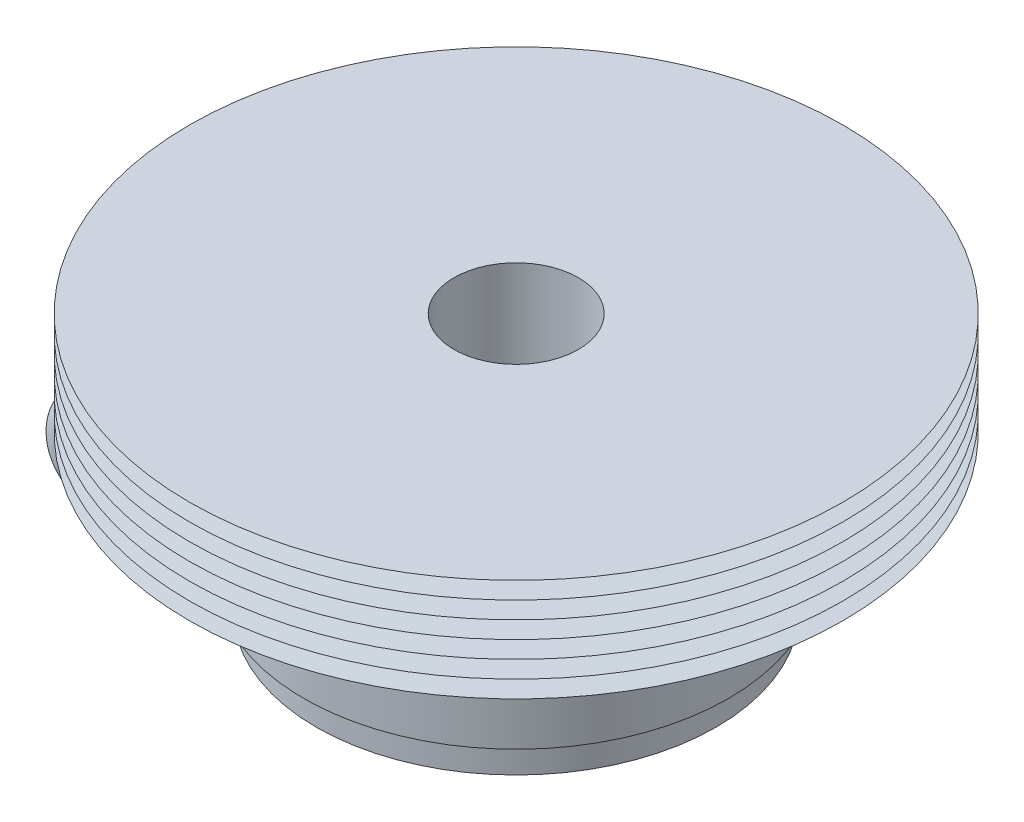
ISO-10303-21;
HEADER;
FILE_DESCRIPTION(('STEP AP214'),'2;1');
FILE_NAME('part.step','',(''),(''),'','','');
FILE_SCHEMA(('AUTOMOTIVE_DESIGN { 1 0 10303 214 1 1 1 1 }'));
ENDSEC;
DATA;
#1=APPLICATION_CONTEXT('core data for automotive mechanical design processes');
#2=APPLICATION_PROTOCOL_DEFINITION('international standard','automotive_design',2000,#1);
#3=PRODUCT_CONTEXT('',#1,'mechanical');
#4=PRODUCT('Part','Part','',(#3));
#5=PRODUCT_RELATED_PRODUCT_CATEGORY('part','',(#4));
#6=PRODUCT_DEFINITION_FORMATION('','',#4);
#7=PRODUCT_DEFINITION_CONTEXT('part definition',#1,'design');
#8=PRODUCT_DEFINITION('design','',#6,#7);
#9=PRODUCT_DEFINITION_SHAPE('','',#8);
#10=(LENGTH_UNIT() NAMED_UNIT(*) SI_UNIT(.MILLI.,.METRE.));
#11=(NAMED_UNIT(*) PLANE_ANGLE_UNIT() SI_UNIT($,.RADIAN.));
#12=(NAMED_UNIT(*) SI_UNIT($,.STERADIAN.) SOLID_ANGLE_UNIT());
#13=UNCERTAINTY_MEASURE_WITH_UNIT(LENGTH_MEASURE(1.E-05),#10,'distance_accuracy_value','');
#14=(GEOMETRIC_REPRESENTATION_CONTEXT(3) GLOBAL_UNCERTAINTY_ASSIGNED_CONTEXT((#13)) GLOBAL_UNIT_ASSIGNED_CONTEXT((#10,
#11,#12)) REPRESENTATION_CONTEXT('',''));
#15=CARTESIAN_POINT('',(0.,0.,0.));
#16=DIRECTION('',(0.,0.,1.));
#17=DIRECTION('',(1.,0.,0.));
#18=AXIS2_PLACEMENT_3D('',#15,#16,#17);
#19=CARTESIAN_POINT('',(0.,0.,0.));
#20=DIRECTION('',(0.,-1.,0.));
#21=DIRECTION('',(0.,0.,-1.));
#22=AXIS2_PLACEMENT_3D('',#19,#20,#21);
#23=CYLINDRICAL_SURFACE('',#22,13.65);
#24=CARTESIAN_POINT('',(0.,8.,0.));
#25=DIRECTION('',(0.,-1.,0.));
#26=DIRECTION('',(0.,0.,-1.));
#27=AXIS2_PLACEMENT_3D('',#24,#25,#26);
#28=CIRCLE('',#27,13.65);
#29=CARTESIAN_POINT('',(-12.85,8.,-4.60434577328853));
#30=VERTEX_POINT('',#29);
#31=CARTESIAN_POINT('',(-12.85,8.,4.60434577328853));
#32=VERTEX_POINT('',#31);
#33=EDGE_CURVE('E11',#30,#32,#28,.T.);
#34=ORIENTED_EDGE('',*,*,#33,.T.);
#35=DIRECTION('',(0.,-1.,0.));
#36=VECTOR('',#35,1.);
#37=CARTESIAN_POINT('',(-12.85,0.,4.60434577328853));
#38=LINE('',#37,#36);
#39=CARTESIAN_POINT('',(-12.85,2.,4.60434577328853));
#40=VERTEX_POINT('',#39);
#41=EDGE_CURVE('E26',#32,#40,#38,.T.);
#42=ORIENTED_EDGE('',*,*,#41,.T.);
#43=CARTESIAN_POINT('',(0.,2.,0.));
#44=DIRECTION('',(0.,-1.,0.));
#45=DIRECTION('',(0.,0.,-1.));
#46=AXIS2_PLACEMENT_3D('',#43,#44,#45);
#47=CIRCLE('',#46,13.65);
#48=CARTESIAN_POINT('',(-12.85,2.,-4.60434577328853));
#49=VERTEX_POINT('',#48);
#50=EDGE_CURVE('E50',#49,#40,#47,.T.);
#51=ORIENTED_EDGE('',*,*,#50,.F.);
#52=DIRECTION('',(0.,1.,0.));
#53=VECTOR('',#52,1.);
#54=CARTESIAN_POINT('',(-12.85,0.,-4.60434577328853));
#55=LINE('',#54,#53);
#56=EDGE_CURVE('E191',#49,#30,#55,.T.);
#57=ORIENTED_EDGE('',*,*,#56,.T.);
#58=EDGE_LOOP('',(#34,#42,#51,#57));
#59=FACE_BOUND('',#58,.T.);
#60=ADVANCED_FACE('F16',(#59),#23,.T.);
#61=CARTESIAN_POINT('',(0.,0.,0.));
#62=DIRECTION('',(0.,-1.,0.));
#63=DIRECTION('',(0.,0.,-1.));
#64=AXIS2_PLACEMENT_3D('',#61,#62,#63);
#65=CYLINDRICAL_SURFACE('',#64,4.);
#66=CARTESIAN_POINT('',(0.,4.,0.));
#67=DIRECTION('',(0.,-1.,0.));
#68=DIRECTION('',(0.,0.,-1.));
#69=AXIS2_PLACEMENT_3D('',#66,#67,#68);
#70=CIRCLE('',#69,4.);
#71=CARTESIAN_POINT('',(0.,4.,-4.));
#72=VERTEX_POINT('',#71);
#73=EDGE_CURVE('E187',#72,#72,#70,.T.);
#74=ORIENTED_EDGE('',*,*,#73,.T.);
#75=EDGE_LOOP('',(#74));
#76=FACE_BOUND('',#75,.T.);
#77=CARTESIAN_POINT('',(0.,16.6,0.));
#78=DIRECTION('',(0.,-1.,0.));
#79=DIRECTION('',(0.,0.,-1.));
#80=AXIS2_PLACEMENT_3D('',#77,#78,#79);
#81=CIRCLE('',#80,4.);
#82=CARTESIAN_POINT('',(0.,16.6,-4.));
#83=VERTEX_POINT('',#82);
#84=EDGE_CURVE('E177',#83,#83,#81,.T.);
#85=ORIENTED_EDGE('',*,*,#84,.F.);
#86=EDGE_LOOP('',(#85));
#87=FACE_BOUND('',#86,.T.);
#88=ADVANCED_FACE('F333',(#76,#87),#65,.F.);
#89=CARTESIAN_POINT('',(4.,4.,0.));
#90=DIRECTION('',(0.,-1.,0.));
#91=DIRECTION('',(0.,0.,-1.));
#92=AXIS2_PLACEMENT_3D('',#89,#90,#91);
#93=PLANE('',#92);
#94=CARTESIAN_POINT('',(0.,4.,0.));
#95=DIRECTION('',(0.,-1.,0.));
#96=DIRECTION('',(0.,0.,-1.));
#97=AXIS2_PLACEMENT_3D('',#94,#95,#96);
#98=CIRCLE('',#97,8.);
#99=CARTESIAN_POINT('',(0.,4.,-8.));
#100=VERTEX_POINT('',#99);
#101=EDGE_CURVE('E192',#100,#100,#98,.T.);
#102=ORIENTED_EDGE('',*,*,#101,.T.);
#103=EDGE_LOOP('',(#102));
#104=FACE_BOUND('',#103,.T.);
#105=ORIENTED_EDGE('',*,*,#73,.F.);
#106=EDGE_LOOP('',(#105));
#107=FACE_BOUND('',#106,.T.);
#108=ADVANCED_FACE('F340',(#104,#107),#93,.T.);
#109=CARTESIAN_POINT('',(0.,0.,0.));
#110=DIRECTION('',(0.,-1.,0.));
#111=DIRECTION('',(0.,0.,-1.));
#112=AXIS2_PLACEMENT_3D('',#109,#110,#111);
#113=CYLINDRICAL_SURFACE('',#112,8.);
#114=CARTESIAN_POINT('',(0.,0.,0.));
#115=DIRECTION('',(0.,-1.,0.));
#116=DIRECTION('',(0.,0.,-1.));
#117=AXIS2_PLACEMENT_3D('',#114,#115,#116);
#118=CIRCLE('',#117,8.);
#119=CARTESIAN_POINT('',(0.,0.,-8.));
#120=VERTEX_POINT('',#119);
#121=EDGE_CURVE('E224',#120,#120,#118,.T.);
#122=ORIENTED_EDGE('',*,*,#121,.T.);
#123=EDGE_LOOP('',(#122));
#124=FACE_BOUND('',#123,.T.);
#125=ORIENTED_EDGE('',*,*,#101,.F.);
#126=EDGE_LOOP('',(#125));
#127=FACE_BOUND('',#126,.T.);
#128=ADVANCED_FACE('F381',(#124,#127),#113,.F.);
#129=CARTESIAN_POINT('',(8.,0.,0.));
#130=DIRECTION('',(0.,-1.,0.));
#131=DIRECTION('',(0.,0.,-1.));
#132=AXIS2_PLACEMENT_3D('',#129,#130,#131);
#133=PLANE('',#132);
#134=CARTESIAN_POINT('',(0.,0.,0.));
#135=DIRECTION('',(0.,-1.,0.));
#136=DIRECTION('',(0.,0.,-1.));
#137=AXIS2_PLACEMENT_3D('',#134,#135,#136);
#138=CIRCLE('',#137,12.85);
#139=CARTESIAN_POINT('',(0.,0.,-12.85));
#140=VERTEX_POINT('',#139);
#141=EDGE_CURVE('E296',#140,#140,#138,.T.);
#142=ORIENTED_EDGE('',*,*,#141,.T.);
#143=EDGE_LOOP('',(#142));
#144=FACE_BOUND('',#143,.T.);
#145=ORIENTED_EDGE('',*,*,#121,.F.);
#146=EDGE_LOOP('',(#145));
#147=FACE_BOUND('',#146,.T.);
#148=ADVANCED_FACE('F356',(#144,#147),#133,.T.);
#149=CARTESIAN_POINT('',(0.,0.,0.));
#150=DIRECTION('',(0.,-1.,0.));
#151=DIRECTION('',(0.,0.,-1.));
#152=AXIS2_PLACEMENT_3D('',#149,#150,#151);
#153=CYLINDRICAL_SURFACE('',#152,12.85);
#154=CARTESIAN_POINT('',(0.,2.,0.));
#155=DIRECTION('',(0.,-1.,0.));
#156=DIRECTION('',(0.,0.,-1.));
#157=AXIS2_PLACEMENT_3D('',#154,#155,#156);
#158=CIRCLE('',#157,12.85);
#159=CARTESIAN_POINT('',(0.,2.,-12.85));
#160=VERTEX_POINT('',#159);
#161=EDGE_CURVE('E185',#160,#160,#158,.T.);
#162=ORIENTED_EDGE('',*,*,#161,.T.);
#163=EDGE_LOOP('',(#162));
#164=FACE_BOUND('',#163,.T.);
#165=ORIENTED_EDGE('',*,*,#141,.F.);
#166=EDGE_LOOP('',(#165));
#167=FACE_BOUND('',#166,.T.);
#168=ADVANCED_FACE('F352',(#164,#167),#153,.T.);
#169=CARTESIAN_POINT('',(12.85,2.,0.));
#170=DIRECTION('',(0.,-1.,0.));
#171=DIRECTION('',(0.,0.,-1.));
#172=AXIS2_PLACEMENT_3D('',#169,#170,#171);
#173=PLANE('',#172);
#174=DIRECTION('',(0.,0.,-1.));
#175=VECTOR('',#174,1.);
#176=CARTESIAN_POINT('',(-12.85,2.,7.));
#177=LINE('',#176,#175);
#178=CARTESIAN_POINT('',(-12.85,2.,-7.));
#179=VERTEX_POINT('',#178);
#180=EDGE_CURVE('E243',#49,#179,#177,.T.);
#181=ORIENTED_EDGE('',*,*,#180,.F.);
#182=ORIENTED_EDGE('',*,*,#50,.T.);
#183=DIRECTION('',(0.,0.,-1.));
#184=VECTOR('',#183,1.);
#185=CARTESIAN_POINT('',(-12.85,2.,7.));
#186=LINE('',#185,#184);
#187=CARTESIAN_POINT('',(-12.85,2.,7.));
#188=VERTEX_POINT('',#187);
#189=EDGE_CURVE('E201',#188,#40,#186,.T.);
#190=ORIENTED_EDGE('',*,*,#189,.F.);
#191=DIRECTION('',(1.,0.,0.));
#192=VECTOR('',#191,1.);
#193=CARTESIAN_POINT('',(-17.35,2.,7.));
#194=LINE('',#193,#192);
#195=CARTESIAN_POINT('',(-16.1,2.,7.));
#196=VERTEX_POINT('',#195);
#197=EDGE_CURVE('E179',#196,#188,#194,.T.);
#198=ORIENTED_EDGE('',*,*,#197,.F.);
#199=DIRECTION('',(1.,0.,0.));
#200=VECTOR('',#199,1.);
#201=CARTESIAN_POINT('',(-17.35,2.,7.));
#202=LINE('',#201,#200);
#203=CARTESIAN_POINT('',(-17.35,2.,7.));
#204=VERTEX_POINT('',#203);
#205=EDGE_CURVE('E225',#204,#196,#202,.T.);
#206=ORIENTED_EDGE('',*,*,#205,.F.);
#207=DIRECTION('',(0.,0.,-1.));
#208=VECTOR('',#207,1.);
#209=CARTESIAN_POINT('',(-17.35,2.,7.));
#210=LINE('',#209,#208);
#211=CARTESIAN_POINT('',(-17.35,2.,-7.));
#212=VERTEX_POINT('',#211);
#213=EDGE_CURVE('E186',#204,#212,#210,.T.);
#214=ORIENTED_EDGE('',*,*,#213,.T.);
#215=DIRECTION('',(1.,0.,0.));
#216=VECTOR('',#215,1.);
#217=CARTESIAN_POINT('',(-17.35,2.,-7.));
#218=LINE('',#217,#216);
#219=EDGE_CURVE('E257',#212,#179,#218,.T.);
#220=ORIENTED_EDGE('',*,*,#219,.T.);
#221=EDGE_LOOP('',(#181,#182,#190,#198,#206,#214,#220));
#222=FACE_BOUND('',#221,.T.);
#223=ORIENTED_EDGE('',*,*,#161,.F.);
#224=EDGE_LOOP('',(#223));
#225=FACE_BOUND('',#224,.T.);
#226=ADVANCED_FACE('F355',(#222,#225),#173,.T.);
#227=CARTESIAN_POINT('',(13.65,8.,0.));
#228=DIRECTION('',(0.,1.,0.));
#229=DIRECTION('',(1.,0.,0.));
#230=AXIS2_PLACEMENT_3D('',#227,#228,#229);
#231=PLANE('',#230);
#232=CARTESIAN_POINT('',(0.,8.,0.));
#233=DIRECTION('',(0.,-1.,0.));
#234=DIRECTION('',(0.,0.,-1.));
#235=AXIS2_PLACEMENT_3D('',#232,#233,#234);
#236=CIRCLE('',#235,12.85);
#237=CARTESIAN_POINT('',(0.,8.,-12.85));
#238=VERTEX_POINT('',#237);
#239=EDGE_CURVE('E253',#238,#238,#236,.T.);
#240=ORIENTED_EDGE('',*,*,#239,.T.);
#241=EDGE_LOOP('',(#240));
#242=FACE_BOUND('',#241,.T.);
#243=ORIENTED_EDGE('',*,*,#33,.F.);
#244=DIRECTION('',(0.,0.,-1.));
#245=VECTOR('',#244,1.);
#246=CARTESIAN_POINT('',(-12.85,8.,7.));
#247=LINE('',#246,#245);
#248=CARTESIAN_POINT('',(-12.85,8.,-7.));
#249=VERTEX_POINT('',#248);
#250=EDGE_CURVE('E242',#30,#249,#247,.T.);
#251=ORIENTED_EDGE('',*,*,#250,.T.);
#252=DIRECTION('',(-1.,0.,0.));
#253=VECTOR('',#252,1.);
#254=CARTESIAN_POINT('',(-12.85,8.,-7.));
#255=LINE('',#254,#253);
#256=CARTESIAN_POINT('',(-17.35,8.,-7.));
#257=VERTEX_POINT('',#256);
#258=EDGE_CURVE('E238',#249,#257,#255,.T.);
#259=ORIENTED_EDGE('',*,*,#258,.T.);
#260=DIRECTION('',(0.,0.,-1.));
#261=VECTOR('',#260,1.);
#262=CARTESIAN_POINT('',(-17.35,8.,7.));
#263=LINE('',#262,#261);
#264=CARTESIAN_POINT('',(-17.35,8.,7.));
#265=VERTEX_POINT('',#264);
#266=EDGE_CURVE('E204',#265,#257,#263,.T.);
#267=ORIENTED_EDGE('',*,*,#266,.F.);
#268=DIRECTION('',(-1.,0.,0.));
#269=VECTOR('',#268,1.);
#270=CARTESIAN_POINT('',(-12.85,8.,7.));
#271=LINE('',#270,#269);
#272=CARTESIAN_POINT('',(-16.1,8.,7.));
#273=VERTEX_POINT('',#272);
#274=EDGE_CURVE('E270',#273,#265,#271,.T.);
#275=ORIENTED_EDGE('',*,*,#274,.F.);
#276=DIRECTION('',(-1.,0.,0.));
#277=VECTOR('',#276,1.);
#278=CARTESIAN_POINT('',(-12.85,8.,7.));
#279=LINE('',#278,#277);
#280=CARTESIAN_POINT('',(-12.85,8.,7.));
#281=VERTEX_POINT('',#280);
#282=EDGE_CURVE('E205',#281,#273,#279,.T.);
#283=ORIENTED_EDGE('',*,*,#282,.F.);
#284=DIRECTION('',(0.,0.,-1.));
#285=VECTOR('',#284,1.);
#286=CARTESIAN_POINT('',(-12.85,8.,7.));
#287=LINE('',#286,#285);
#288=EDGE_CURVE('E209',#281,#32,#287,.T.);
#289=ORIENTED_EDGE('',*,*,#288,.T.);
#290=EDGE_LOOP('',(#243,#251,#259,#267,#275,#283,#289));
#291=FACE_BOUND('',#290,.T.);
#292=ADVANCED_FACE('F386',(#242,#291),#231,.T.);
#293=CARTESIAN_POINT('',(0.,0.,0.));
#294=DIRECTION('',(0.,-1.,0.));
#295=DIRECTION('',(0.,0.,-1.));
#296=AXIS2_PLACEMENT_3D('',#293,#294,#295);
#297=CYLINDRICAL_SURFACE('',#296,12.85);
#298=CARTESIAN_POINT('',(0.,10.,0.));
#299=DIRECTION('',(0.,-1.,0.));
#300=DIRECTION('',(0.,0.,-1.));
#301=AXIS2_PLACEMENT_3D('',#298,#299,#300);
#302=CIRCLE('',#301,12.85);
#303=CARTESIAN_POINT('',(0.,10.,-12.85));
#304=VERTEX_POINT('',#303);
#305=EDGE_CURVE('E170',#304,#304,#302,.T.);
#306=ORIENTED_EDGE('',*,*,#305,.T.);
#307=EDGE_LOOP('',(#306));
#308=FACE_BOUND('',#307,.T.);
#309=ORIENTED_EDGE('',*,*,#239,.F.);
#310=EDGE_LOOP('',(#309));
#311=FACE_BOUND('',#310,.T.);
#312=ADVANCED_FACE('F389',(#308,#311),#297,.T.);
#313=CARTESIAN_POINT('',(12.85,10.,0.));
#314=DIRECTION('',(0.,-1.,0.));
#315=DIRECTION('',(0.,0.,-1.));
#316=AXIS2_PLACEMENT_3D('',#313,#314,#315);
#317=PLANE('',#316);
#318=CARTESIAN_POINT('',(0.,10.,0.));
#319=DIRECTION('',(0.,-1.,0.));
#320=DIRECTION('',(0.,0.,-1.));
#321=AXIS2_PLACEMENT_3D('',#318,#319,#320);
#322=CIRCLE('',#321,21.);
#323=CARTESIAN_POINT('',(0.,10.,-21.));
#324=VERTEX_POINT('',#323);
#325=EDGE_CURVE('E162',#324,#324,#322,.T.);
#326=ORIENTED_EDGE('',*,*,#325,.T.);
#327=EDGE_LOOP('',(#326));
#328=FACE_BOUND('',#327,.T.);
#329=ORIENTED_EDGE('',*,*,#305,.F.);
#330=EDGE_LOOP('',(#329));
#331=FACE_BOUND('',#330,.T.);
#332=ADVANCED_FACE('F367',(#328,#331),#317,.T.);
#333=CARTESIAN_POINT('',(0.,10.,0.));
#334=DIRECTION('',(0.,-1.,0.));
#335=DIRECTION('',(0.,0.,-1.));
#336=AXIS2_PLACEMENT_3D('',#333,#334,#335);
#337=CONICAL_SURFACE('',#336,21.,1.52682468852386);
#338=CARTESIAN_POINT('',(0.,10.55,0.));
#339=DIRECTION('',(0.,-1.,0.));
#340=DIRECTION('',(0.,0.,-1.));
#341=AXIS2_PLACEMENT_3D('',#338,#339,#340);
#342=CIRCLE('',#341,8.5);
#343=CARTESIAN_POINT('',(0.,10.55,-8.5));
#344=VERTEX_POINT('',#343);
#345=EDGE_CURVE('E158',#344,#344,#342,.T.);
#346=ORIENTED_EDGE('',*,*,#345,.T.);
#347=EDGE_LOOP('',(#346));
#348=FACE_BOUND('',#347,.T.);
#349=ORIENTED_EDGE('',*,*,#325,.F.);
#350=EDGE_LOOP('',(#349));
#351=FACE_BOUND('',#350,.T.);
#352=ADVANCED_FACE('F364',(#348,#351),#337,.T.);
#353=CARTESIAN_POINT('',(0.,10.55,0.));
#354=DIRECTION('',(0.,1.,0.));
#355=DIRECTION('',(0.,0.,1.));
#356=AXIS2_PLACEMENT_3D('',#353,#354,#355);
#357=CONICAL_SURFACE('',#356,8.5,1.52682468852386);
#358=CARTESIAN_POINT('',(0.,11.1,0.));
#359=DIRECTION('',(0.,-1.,0.));
#360=DIRECTION('',(0.,0.,-1.));
#361=AXIS2_PLACEMENT_3D('',#358,#359,#360);
#362=CIRCLE('',#361,21.);
#363=CARTESIAN_POINT('',(0.,11.1,-21.));
#364=VERTEX_POINT('',#363);
#365=EDGE_CURVE('E163',#364,#364,#362,.T.);
#366=ORIENTED_EDGE('',*,*,#365,.T.);
#367=EDGE_LOOP('',(#366));
#368=FACE_BOUND('',#367,.T.);
#369=ORIENTED_EDGE('',*,*,#345,.F.);
#370=EDGE_LOOP('',(#369));
#371=FACE_BOUND('',#370,.T.);
#372=ADVANCED_FACE('F159',(#368,#371),#357,.T.);
#373=CARTESIAN_POINT('',(0.,11.1,0.));
#374=DIRECTION('',(0.,-1.,0.));
#375=DIRECTION('',(0.,0.,-1.));
#376=AXIS2_PLACEMENT_3D('',#373,#374,#375);
#377=CONICAL_SURFACE('',#376,21.,1.52682468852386);
#378=CARTESIAN_POINT('',(0.,11.65,0.));
#379=DIRECTION('',(0.,-1.,0.));
#380=DIRECTION('',(0.,0.,-1.));
#381=AXIS2_PLACEMENT_3D('',#378,#379,#380);
#382=CIRCLE('',#381,8.5);
#383=CARTESIAN_POINT('',(0.,11.65,-8.5));
#384=VERTEX_POINT('',#383);
#385=EDGE_CURVE('E174',#384,#384,#382,.T.);
#386=ORIENTED_EDGE('',*,*,#385,.T.);
#387=EDGE_LOOP('',(#386));
#388=FACE_BOUND('',#387,.T.);
#389=ORIENTED_EDGE('',*,*,#365,.F.);
#390=EDGE_LOOP('',(#389));
#391=FACE_BOUND('',#390,.T.);
#392=ADVANCED_FACE('F310',(#388,#391),#377,.T.);
#393=CARTESIAN_POINT('',(0.,11.65,0.));
#394=DIRECTION('',(0.,1.,0.));
#395=DIRECTION('',(0.,0.,1.));
#396=AXIS2_PLACEMENT_3D('',#393,#394,#395);
#397=CONICAL_SURFACE('',#396,8.5,1.52682468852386);
#398=CARTESIAN_POINT('',(0.,12.2,0.));
#399=DIRECTION('',(0.,-1.,0.));
#400=DIRECTION('',(0.,0.,-1.));
#401=AXIS2_PLACEMENT_3D('',#398,#399,#400);
#402=CIRCLE('',#401,21.);
#403=CARTESIAN_POINT('',(0.,12.2,-21.));
#404=VERTEX_POINT('',#403);
#405=EDGE_CURVE('E278',#404,#404,#402,.T.);
#406=ORIENTED_EDGE('',*,*,#405,.T.);
#407=EDGE_LOOP('',(#406));
#408=FACE_BOUND('',#407,.T.);
#409=ORIENTED_EDGE('',*,*,#385,.F.);
#410=EDGE_LOOP('',(#409));
#411=FACE_BOUND('',#410,.T.);
#412=ADVANCED_FACE('F316',(#408,#411),#397,.T.);
#413=CARTESIAN_POINT('',(0.,12.2,0.));
#414=DIRECTION('',(0.,-1.,0.));
#415=DIRECTION('',(0.,0.,-1.));
#416=AXIS2_PLACEMENT_3D('',#413,#414,#415);
#417=CONICAL_SURFACE('',#416,21.,1.52682468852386);
#418=CARTESIAN_POINT('',(0.,12.75,0.));
#419=DIRECTION('',(0.,-1.,0.));
#420=DIRECTION('',(0.,0.,-1.));
#421=AXIS2_PLACEMENT_3D('',#418,#419,#420);
#422=CIRCLE('',#421,8.5);
#423=CARTESIAN_POINT('',(0.,12.75,-8.5));
#424=VERTEX_POINT('',#423);
#425=EDGE_CURVE('E273',#424,#424,#422,.T.);
#426=ORIENTED_EDGE('',*,*,#425,.T.);
#427=EDGE_LOOP('',(#426));
#428=FACE_BOUND('',#427,.T.);
#429=ORIENTED_EDGE('',*,*,#405,.F.);
#430=EDGE_LOOP('',(#429));
#431=FACE_BOUND('',#430,.T.);
#432=ADVANCED_FACE('F318',(#428,#431),#417,.T.);
#433=CARTESIAN_POINT('',(0.,12.75,0.));
#434=DIRECTION('',(0.,1.,0.));
#435=DIRECTION('',(0.,0.,1.));
#436=AXIS2_PLACEMENT_3D('',#433,#434,#435);
#437=CONICAL_SURFACE('',#436,8.5,1.52682468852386);
#438=CARTESIAN_POINT('',(0.,13.3,0.));
#439=DIRECTION('',(0.,-1.,0.));
#440=DIRECTION('',(0.,0.,-1.));
#441=AXIS2_PLACEMENT_3D('',#438,#439,#440);
#442=CIRCLE('',#441,21.);
#443=CARTESIAN_POINT('',(0.,13.3,-21.));
#444=VERTEX_POINT('',#443);
#445=EDGE_CURVE('E214',#444,#444,#442,.T.);
#446=ORIENTED_EDGE('',*,*,#445,.T.);
#447=EDGE_LOOP('',(#446));
#448=FACE_BOUND('',#447,.T.);
#449=ORIENTED_EDGE('',*,*,#425,.F.);
#450=EDGE_LOOP('',(#449));
#451=FACE_BOUND('',#450,.T.);
#452=ADVANCED_FACE('F327',(#448,#451),#437,.T.);
#453=CARTESIAN_POINT('',(0.,13.3,0.));
#454=DIRECTION('',(0.,-1.,0.));
#455=DIRECTION('',(0.,0.,-1.));
#456=AXIS2_PLACEMENT_3D('',#453,#454,#455);
#457=CONICAL_SURFACE('',#456,21.,1.52682468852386);
#458=CARTESIAN_POINT('',(0.,13.85,0.));
#459=DIRECTION('',(0.,-1.,0.));
#460=DIRECTION('',(0.,0.,-1.));
#461=AXIS2_PLACEMENT_3D('',#458,#459,#460);
#462=CIRCLE('',#461,8.5);
#463=CARTESIAN_POINT('',(0.,13.85,-8.5));
#464=VERTEX_POINT('',#463);
#465=EDGE_CURVE('E210',#464,#464,#462,.T.);
#466=ORIENTED_EDGE('',*,*,#465,.T.);
#467=EDGE_LOOP('',(#466));
#468=FACE_BOUND('',#467,.T.);
#469=ORIENTED_EDGE('',*,*,#445,.F.);
#470=EDGE_LOOP('',(#469));
#471=FACE_BOUND('',#470,.T.);
#472=ADVANCED_FACE('F391',(#468,#471),#457,.T.);
#473=CARTESIAN_POINT('',(0.,13.85,0.));
#474=DIRECTION('',(0.,1.,0.));
#475=DIRECTION('',(0.,0.,1.));
#476=AXIS2_PLACEMENT_3D('',#473,#474,#475);
#477=CONICAL_SURFACE('',#476,8.5,1.52682468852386);
#478=CARTESIAN_POINT('',(0.,14.4,0.));
#479=DIRECTION('',(0.,-1.,0.));
#480=DIRECTION('',(0.,0.,-1.));
#481=AXIS2_PLACEMENT_3D('',#478,#479,#480);
#482=CIRCLE('',#481,21.);
#483=CARTESIAN_POINT('',(0.,14.4,-21.));
#484=VERTEX_POINT('',#483);
#485=EDGE_CURVE('E199',#484,#484,#482,.T.);
#486=ORIENTED_EDGE('',*,*,#485,.T.);
#487=EDGE_LOOP('',(#486));
#488=FACE_BOUND('',#487,.T.);
#489=ORIENTED_EDGE('',*,*,#465,.F.);
#490=EDGE_LOOP('',(#489));
#491=FACE_BOUND('',#490,.T.);
#492=ADVANCED_FACE('F394',(#488,#491),#477,.T.);
#493=CARTESIAN_POINT('',(0.,14.4,0.));
#494=DIRECTION('',(0.,-1.,0.));
#495=DIRECTION('',(0.,0.,-1.));
#496=AXIS2_PLACEMENT_3D('',#493,#494,#495);
#497=CONICAL_SURFACE('',#496,21.,1.52682468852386);
#498=CARTESIAN_POINT('',(0.,14.95,0.));
#499=DIRECTION('',(0.,-1.,0.));
#500=DIRECTION('',(0.,0.,-1.));
#501=AXIS2_PLACEMENT_3D('',#498,#499,#500);
#502=CIRCLE('',#501,8.5);
#503=CARTESIAN_POINT('',(0.,14.95,-8.5));
#504=VERTEX_POINT('',#503);
#505=EDGE_CURVE('E195',#504,#504,#502,.T.);
#506=ORIENTED_EDGE('',*,*,#505,.T.);
#507=EDGE_LOOP('',(#506));
#508=FACE_BOUND('',#507,.T.);
#509=ORIENTED_EDGE('',*,*,#485,.F.);
#510=EDGE_LOOP('',(#509));
#511=FACE_BOUND('',#510,.T.);
#512=ADVANCED_FACE('F362',(#508,#511),#497,.T.);
#513=CARTESIAN_POINT('',(0.,14.95,0.));
#514=DIRECTION('',(0.,1.,0.));
#515=DIRECTION('',(0.,0.,1.));
#516=AXIS2_PLACEMENT_3D('',#513,#514,#515);
#517=CONICAL_SURFACE('',#516,8.5,1.52682468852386);
#518=CARTESIAN_POINT('',(0.,15.5,0.));
#519=DIRECTION('',(0.,-1.,0.));
#520=DIRECTION('',(0.,0.,-1.));
#521=AXIS2_PLACEMENT_3D('',#518,#519,#520);
#522=CIRCLE('',#521,21.);
#523=CARTESIAN_POINT('',(0.,15.5,-21.));
#524=VERTEX_POINT('',#523);
#525=EDGE_CURVE('E200',#524,#524,#522,.T.);
#526=ORIENTED_EDGE('',*,*,#525,.T.);
#527=EDGE_LOOP('',(#526));
#528=FACE_BOUND('',#527,.T.);
#529=ORIENTED_EDGE('',*,*,#505,.F.);
#530=EDGE_LOOP('',(#529));
#531=FACE_BOUND('',#530,.T.);
#532=ADVANCED_FACE('F358',(#528,#531),#517,.T.);
#533=CARTESIAN_POINT('',(0.,15.5,0.));
#534=DIRECTION('',(0.,-1.,0.));
#535=DIRECTION('',(0.,0.,-1.));
#536=AXIS2_PLACEMENT_3D('',#533,#534,#535);
#537=CONICAL_SURFACE('',#536,21.,1.52682468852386);
#538=CARTESIAN_POINT('',(0.,16.05,0.));
#539=DIRECTION('',(0.,-1.,0.));
#540=DIRECTION('',(0.,0.,-1.));
#541=AXIS2_PLACEMENT_3D('',#538,#539,#540);
#542=CIRCLE('',#541,8.5);
#543=CARTESIAN_POINT('',(0.,16.05,-8.5));
#544=VERTEX_POINT('',#543);
#545=EDGE_CURVE('E246',#544,#544,#542,.T.);
#546=ORIENTED_EDGE('',*,*,#545,.T.);
#547=EDGE_LOOP('',(#546));
#548=FACE_BOUND('',#547,.T.);
#549=ORIENTED_EDGE('',*,*,#525,.F.);
#550=EDGE_LOOP('',(#549));
#551=FACE_BOUND('',#550,.T.);
#552=ADVANCED_FACE('F361',(#548,#551),#537,.T.);
#553=CARTESIAN_POINT('',(0.,16.05,0.));
#554=DIRECTION('',(0.,1.,0.));
#555=DIRECTION('',(0.,0.,1.));
#556=AXIS2_PLACEMENT_3D('',#553,#554,#555);
#557=CONICAL_SURFACE('',#556,8.5,1.52682468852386);
#558=CARTESIAN_POINT('',(0.,16.6,0.));
#559=DIRECTION('',(0.,-1.,0.));
#560=DIRECTION('',(0.,0.,-1.));
#561=AXIS2_PLACEMENT_3D('',#558,#559,#560);
#562=CIRCLE('',#561,21.);
#563=CARTESIAN_POINT('',(0.,16.6,-21.));
#564=VERTEX_POINT('',#563);
#565=EDGE_CURVE('E250',#564,#564,#562,.T.);
#566=ORIENTED_EDGE('',*,*,#565,.T.);
#567=EDGE_LOOP('',(#566));
#568=FACE_BOUND('',#567,.T.);
#569=ORIENTED_EDGE('',*,*,#545,.F.);
#570=EDGE_LOOP('',(#569));
#571=FACE_BOUND('',#570,.T.);
#572=ADVANCED_FACE('F18',(#568,#571),#557,.T.);
#573=CARTESIAN_POINT('',(21.,16.6,0.));
#574=DIRECTION('',(0.,1.,0.));
#575=DIRECTION('',(1.,0.,0.));
#576=AXIS2_PLACEMENT_3D('',#573,#574,#575);
#577=PLANE('',#576);
#578=ORIENTED_EDGE('',*,*,#84,.T.);
#579=EDGE_LOOP('',(#578));
#580=FACE_BOUND('',#579,.T.);
#581=ORIENTED_EDGE('',*,*,#565,.F.);
#582=EDGE_LOOP('',(#581));
#583=FACE_BOUND('',#582,.T.);
#584=ADVANCED_FACE('F595',(#580,#583),#577,.T.);
#585=CARTESIAN_POINT('',(-12.85,2.,7.));
#586=DIRECTION('',(-1.,0.,0.));
#587=DIRECTION('',(0.,0.,1.));
#588=AXIS2_PLACEMENT_3D('',#585,#586,#587);
#589=PLANE('',#588);
#590=ORIENTED_EDGE('',*,*,#56,.F.);
#591=ORIENTED_EDGE('',*,*,#180,.T.);
#592=DIRECTION('',(0.,1.,0.));
#593=VECTOR('',#592,1.);
#594=CARTESIAN_POINT('',(-12.85,2.,-7.));
#595=LINE('',#594,#593);
#596=EDGE_CURVE('E20',#179,#249,#595,.T.);
#597=ORIENTED_EDGE('',*,*,#596,.T.);
#598=ORIENTED_EDGE('',*,*,#250,.F.);
#599=EDGE_LOOP('',(#590,#591,#597,#598));
#600=FACE_BOUND('',#599,.T.);
#601=ADVANCED_FACE('F377',(#600),#589,.F.);
#602=CARTESIAN_POINT('',(-17.35,5.,7.));
#603=DIRECTION('',(0.,0.,-1.));
#604=DIRECTION('',(-1.,0.,0.));
#605=AXIS2_PLACEMENT_3D('',#602,#603,#604);
#606=CYLINDRICAL_SURFACE('',#605,3.);
#607=CARTESIAN_POINT('',(-17.35,5.,-7.));
#608=DIRECTION('',(0.,0.,1.));
#609=DIRECTION('',(1.,0.,0.));
#610=AXIS2_PLACEMENT_3D('',#607,#608,#609);
#611=CIRCLE('',#610,3.);
#612=EDGE_CURVE('E727',#257,#212,#611,.T.);
#613=ORIENTED_EDGE('',*,*,#612,.T.);
#614=ORIENTED_EDGE('',*,*,#213,.F.);
#615=CARTESIAN_POINT('',(-17.35,5.,7.));
#616=DIRECTION('',(0.,0.,1.));
#617=DIRECTION('',(1.,0.,0.));
#618=AXIS2_PLACEMENT_3D('',#615,#616,#617);
#619=CIRCLE('',#618,3.);
#620=EDGE_CURVE('E219',#265,#204,#619,.T.);
#621=ORIENTED_EDGE('',*,*,#620,.F.);
#622=ORIENTED_EDGE('',*,*,#266,.T.);
#623=EDGE_LOOP('',(#613,#614,#621,#622));
#624=FACE_BOUND('',#623,.T.);
#625=ADVANCED_FACE('F373',(#624),#606,.T.);
#626=CARTESIAN_POINT('',(-12.85,2.,7.));
#627=DIRECTION('',(-1.,0.,0.));
#628=DIRECTION('',(0.,0.,1.));
#629=AXIS2_PLACEMENT_3D('',#626,#627,#628);
#630=PLANE('',#629);
#631=ORIENTED_EDGE('',*,*,#41,.F.);
#632=ORIENTED_EDGE('',*,*,#288,.F.);
#633=DIRECTION('',(0.,1.,0.));
#634=VECTOR('',#633,1.);
#635=CARTESIAN_POINT('',(-12.85,2.,7.));
#636=LINE('',#635,#634);
#637=EDGE_CURVE('E182',#188,#281,#636,.T.);
#638=ORIENTED_EDGE('',*,*,#637,.F.);
#639=ORIENTED_EDGE('',*,*,#189,.T.);
#640=EDGE_LOOP('',(#631,#632,#638,#639));
#641=FACE_BOUND('',#640,.T.);
#642=ADVANCED_FACE('F376',(#641),#630,.F.);
#643=CARTESIAN_POINT('',(-17.35,5.,7.));
#644=DIRECTION('',(0.,0.,1.));
#645=DIRECTION('',(1.,0.,0.));
#646=AXIS2_PLACEMENT_3D('',#643,#644,#645);
#647=PLANE('',#646);
#648=ORIENTED_EDGE('',*,*,#282,.T.);
#649=CARTESIAN_POINT('',(-17.35,5.,7.));
#650=DIRECTION('',(0.,0.,-1.));
#651=DIRECTION('',(1.,0.,0.));
#652=AXIS2_PLACEMENT_3D('',#649,#650,#651);
#653=CIRCLE('',#652,3.25);
#654=EDGE_CURVE('E181',#273,#196,#653,.T.);
#655=ORIENTED_EDGE('',*,*,#654,.T.);
#656=ORIENTED_EDGE('',*,*,#197,.T.);
#657=ORIENTED_EDGE('',*,*,#637,.T.);
#658=EDGE_LOOP('',(#648,#655,#656,#657));
#659=FACE_BOUND('',#658,.T.);
#660=ADVANCED_FACE('F350',(#659),#647,.T.);
#661=CARTESIAN_POINT('',(-17.35,5.,-7.));
#662=DIRECTION('',(0.,0.,1.));
#663=DIRECTION('',(1.,0.,0.));
#664=AXIS2_PLACEMENT_3D('',#661,#662,#663);
#665=PLANE('',#664);
#666=ORIENTED_EDGE('',*,*,#258,.F.);
#667=ORIENTED_EDGE('',*,*,#596,.F.);
#668=ORIENTED_EDGE('',*,*,#219,.F.);
#669=ORIENTED_EDGE('',*,*,#612,.F.);
#670=EDGE_LOOP('',(#666,#667,#668,#669));
#671=FACE_BOUND('',#670,.T.);
#672=ADVANCED_FACE('F347',(#671),#665,.F.);
#673=CARTESIAN_POINT('',(-17.35,8.25,7.));
#674=DIRECTION('',(0.,0.,1.));
#675=DIRECTION('',(1.,0.,0.));
#676=AXIS2_PLACEMENT_3D('',#673,#674,#675);
#677=PLANE('',#676);
#678=ORIENTED_EDGE('',*,*,#205,.T.);
#679=CARTESIAN_POINT('',(-17.35,5.,7.));
#680=DIRECTION('',(0.,0.,-1.));
#681=DIRECTION('',(-1.,0.,0.));
#682=AXIS2_PLACEMENT_3D('',#679,#680,#681);
#683=CIRCLE('',#682,3.25);
#684=EDGE_CURVE('E228',#196,#273,#683,.T.);
#685=ORIENTED_EDGE('',*,*,#684,.T.);
#686=ORIENTED_EDGE('',*,*,#274,.T.);
#687=ORIENTED_EDGE('',*,*,#620,.T.);
#688=EDGE_LOOP('',(#678,#685,#686,#687));
#689=FACE_BOUND('',#688,.T.);
#690=ADVANCED_FACE('F345',(#689),#677,.F.);
#691=CARTESIAN_POINT('',(-17.35,5.,10.5));
#692=DIRECTION('',(0.,0.,-1.));
#693=DIRECTION('',(0.,-1.,0.));
#694=AXIS2_PLACEMENT_3D('',#691,#692,#693);
#695=PLANE('',#694);
#696=CARTESIAN_POINT('',(-17.35,5.,10.5));
#697=DIRECTION('',(0.,0.,-1.));
#698=DIRECTION('',(-1.,0.,0.));
#699=AXIS2_PLACEMENT_3D('',#696,#697,#698);
#700=CIRCLE('',#699,1.75);
#701=CARTESIAN_POINT('',(-19.1,5.,10.5));
#702=VERTEX_POINT('',#701);
#703=EDGE_CURVE('E215',#702,#702,#700,.T.);
#704=ORIENTED_EDGE('',*,*,#703,.F.);
#705=EDGE_LOOP('',(#704));
#706=FACE_BOUND('',#705,.T.);
#707=ADVANCED_FACE('F368',(#706),#695,.F.);
#708=CARTESIAN_POINT('',(-17.35,5.,9.));
#709=DIRECTION('',(0.,0.,-1.));
#710=DIRECTION('',(-1.,0.,0.));
#711=AXIS2_PLACEMENT_3D('',#708,#709,#710);
#712=TOROIDAL_SURFACE('',#711,1.75,1.5);
#713=ORIENTED_EDGE('',*,*,#703,.T.);
#714=EDGE_LOOP('',(#713));
#715=FACE_BOUND('',#714,.T.);
#716=CARTESIAN_POINT('',(-17.35,5.,9.));
#717=DIRECTION('',(0.,0.,-1.));
#718=DIRECTION('',(-1.,0.,0.));
#719=AXIS2_PLACEMENT_3D('',#716,#717,#718);
#720=CIRCLE('',#719,3.25);
#721=CARTESIAN_POINT('',(-20.6,5.,9.));
#722=VERTEX_POINT('',#721);
#723=EDGE_CURVE('E220',#722,#722,#720,.T.);
#724=ORIENTED_EDGE('',*,*,#723,.F.);
#725=EDGE_LOOP('',(#724));
#726=FACE_BOUND('',#725,.T.);
#727=ADVANCED_FACE('F371',(#715,#726),#712,.T.);
#728=CARTESIAN_POINT('',(-17.35,5.,7.));
#729=DIRECTION('',(0.,0.,-1.));
#730=DIRECTION('',(-1.,0.,0.));
#731=AXIS2_PLACEMENT_3D('',#728,#729,#730);
#732=CYLINDRICAL_SURFACE('',#731,3.25);
#733=ORIENTED_EDGE('',*,*,#654,.F.);
#734=ORIENTED_EDGE('',*,*,#684,.F.);
#735=EDGE_LOOP('',(#733,#734));
#736=FACE_BOUND('',#735,.T.);
#737=ORIENTED_EDGE('',*,*,#723,.T.);
#738=EDGE_LOOP('',(#737));
#739=FACE_BOUND('',#738,.T.);
#740=ADVANCED_FACE('F399',(#736,#739),#732,.T.);
#741=CLOSED_SHELL('',(#60,#88,#108,#128,#148,#168,#226,#292,#312,#332,#352,#372,#392,#412,#432,
#452,#472,#492,#512,#532,#552,#572,#584,#601,#625,#642,#660,#672,#690,#707,#727,#740));
#742=MANIFOLD_SOLID_BREP('B1',#741);
#743=ADVANCED_BREP_SHAPE_REPRESENTATION('',(#18,#742),#14);
#744=SHAPE_DEFINITION_REPRESENTATION(#9,#743);
ENDSEC;
END-ISO-10303-21;
